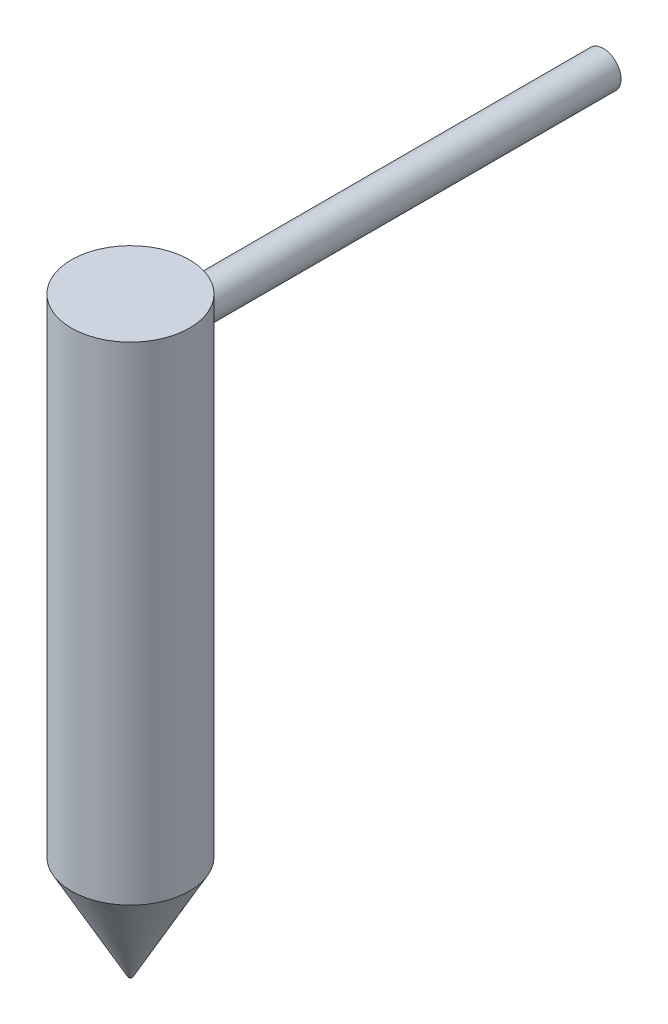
from build123d import *

# Parameters (mm, degrees)
SKETCH1_R           = 50
BOSS_EXTRUDE1_DEPTH = 500
SKETCH3_R           = 15
BOSS_EXTRUDE2_DEPTH = 400


with BuildPart() as part:
    # Sketch1 → Boss-Extrude1 (new body)
    with BuildSketch(Plane(origin=(0, 0, 0), x_dir=(1, 0, 0), z_dir=(0, 1, 0))):
        with Locations(Location((0, 0, 0), (0, 0, 270))):
            Circle(SKETCH1_R)
    extrude(amount=-BOSS_EXTRUDE1_DEPTH)

    # Sketch2 → Cut-Revolve1 (revolve, cut)
    with BuildSketch(Plane(origin=(0, 0, 0), x_dir=(0, 0, -1), z_dir=(1, 0, 0)), mode=Mode.PRIVATE) as cut_revolve1_sk:
        Polygon((1.598728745, -500), (62.978441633, -388.984133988), (72.855209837, -539.397092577), align=None)
    revolve(cut_revolve1_sk.sketch.rotate(Axis((0, -485.20798927, 0), (0, -1, 0)), 180), axis=Axis((0, -485.20798927, 0), (0, -1, 0)), mode=Mode.SUBTRACT)

    # Sketch3 → Boss-Extrude2 (add)
    with BuildSketch(Plane.XY):
        with Locations((0, -35.131614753)):
            Circle(SKETCH3_R)
    extrude(amount=-BOSS_EXTRUDE2_DEPTH)


solid = part.part
